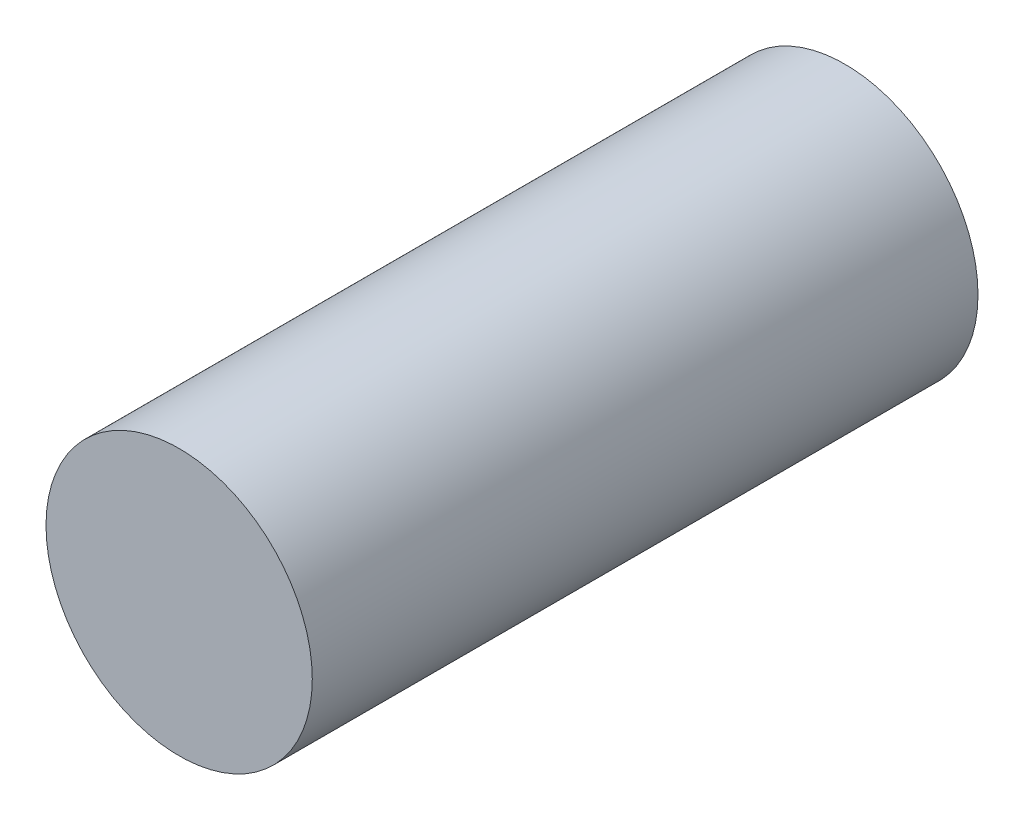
from build123d import *

# Parameters (mm, degrees)
SKETCH1_R           = 30
BOSS_EXTRUDE1_DEPTH = 150


with BuildPart() as part:
    # Sketch1 → Boss-Extrude1 (new body)
    with BuildSketch(Plane.XY):
        Circle(SKETCH1_R)
    extrude(amount=-BOSS_EXTRUDE1_DEPTH)


solid = part.part
